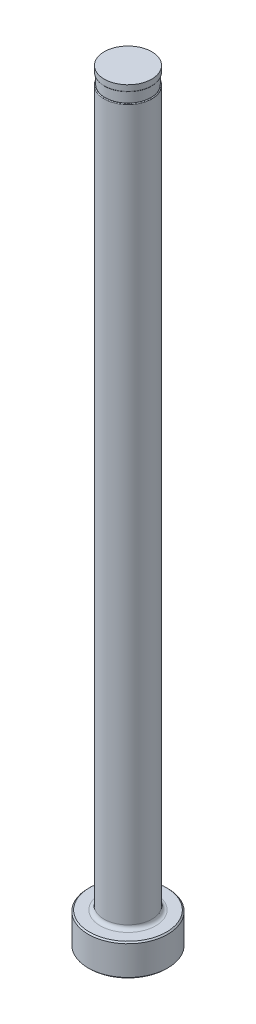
from build123d import *

# Parameters (mm, degrees)
CHAMFER1_SIZE     = 0.254
FILLET1_R         = 0.762
SKETCH2_W         = 0.2032
SKETCH2_H         = 2.032
D_SLOT_DEPTH      = 153.812852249
D_SLOT_DEPTH_BACK = 153.812852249
SKETCH5_W         = 0.01905
SKETCH5_H         = 1.27
FILLET2_R         = 0.127


with BuildPart() as part:
    # Sketch1 → Revolve1 (revolve)
    with BuildSketch(Plane.XY, mode=Mode.PRIVATE) as revolve1_sk:
        Polygon((0, 0), (-7.9375, 0), (-7.9375, 6.35), (-4.7625, 6.35), (-4.7625, 152.4), (0, 152.4), align=None)
    revolve(revolve1_sk.sketch.rotate(Axis((0, 259.958771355, 0), (0, -1, 0)), 270), axis=Axis((0, 259.958771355, 0), (0, -1, 0)))

    # Chamfer1
    chamfer1_edges = [part.edges().sort_by_distance(p)[0] for p in [
        (0, 6.35, -7.9375),
        (0, 0, -7.9375),
    ]]
    chamfer(chamfer1_edges, length=CHAMFER1_SIZE)

    # Fillet1
    fillet1_edges = [part.edges().sort_by_distance(p)[0] for p in [
        (0, 6.35, -4.7625),
    ]]
    fillet(fillet1_edges, radius=FILLET1_R)

    # Sketch2 → Vent Relief (revolve, cut)
    with BuildSketch(Plane.XY, mode=Mode.PRIVATE) as vent_relief_sk:
        with Locations((-4.6609, 150.114)):
            Rectangle(SKETCH2_W, SKETCH2_H)
    revolve(vent_relief_sk.sketch.rotate(Axis((0, 153.448281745, 0), (0, -1, 0)), 270), axis=Axis((0, 153.448281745, 0), (0, -1, 0)), mode=Mode.SUBTRACT)

    # Sketch3 → D-Slot (cut, two sides: drawn at the far end of the back side and taken through both)
    with BuildSketch(Plane.XY.offset(-D_SLOT_DEPTH_BACK)):
        with BuildLine():
            Line((-4.5593, 150.114), (-4.5593, 86.614))
            ThreePointArc((-4.5593, 86.614), (-4.610513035, 86.046038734), (-4.7625, 85.4964))
            Line((-4.7625, 85.4964), (-4.7625, 150.114))
            Line((-4.7625, 150.114), (-4.5593, 150.114))
        make_face()
    extrude(amount=D_SLOT_DEPTH + D_SLOT_DEPTH_BACK, mode=Mode.SUBTRACT)

    # Sketch5 → Vent Diameter (revolve, cut)
    with BuildSketch(Plane.XY, mode=Mode.PRIVATE) as vent_diameter_sk:
        with Locations((-4.752975, 151.765)):
            Rectangle(SKETCH5_W, SKETCH5_H)
    revolve(vent_diameter_sk.sketch.rotate(Axis((0, 152.687735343, 0), (0, -1, 0)), 90), axis=Axis((0, 152.687735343, 0), (0, -1, 0)), mode=Mode.SUBTRACT)

    # Fillet2
    fillet2_edges = [part.edges().sort_by_distance(p)[0] for p in [
        (3.823350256, 149.098, -2.839612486),
        (0, 151.13, 4.74345),
    ]]
    fillet(fillet2_edges, radius=FILLET2_R)


solid = part.part
